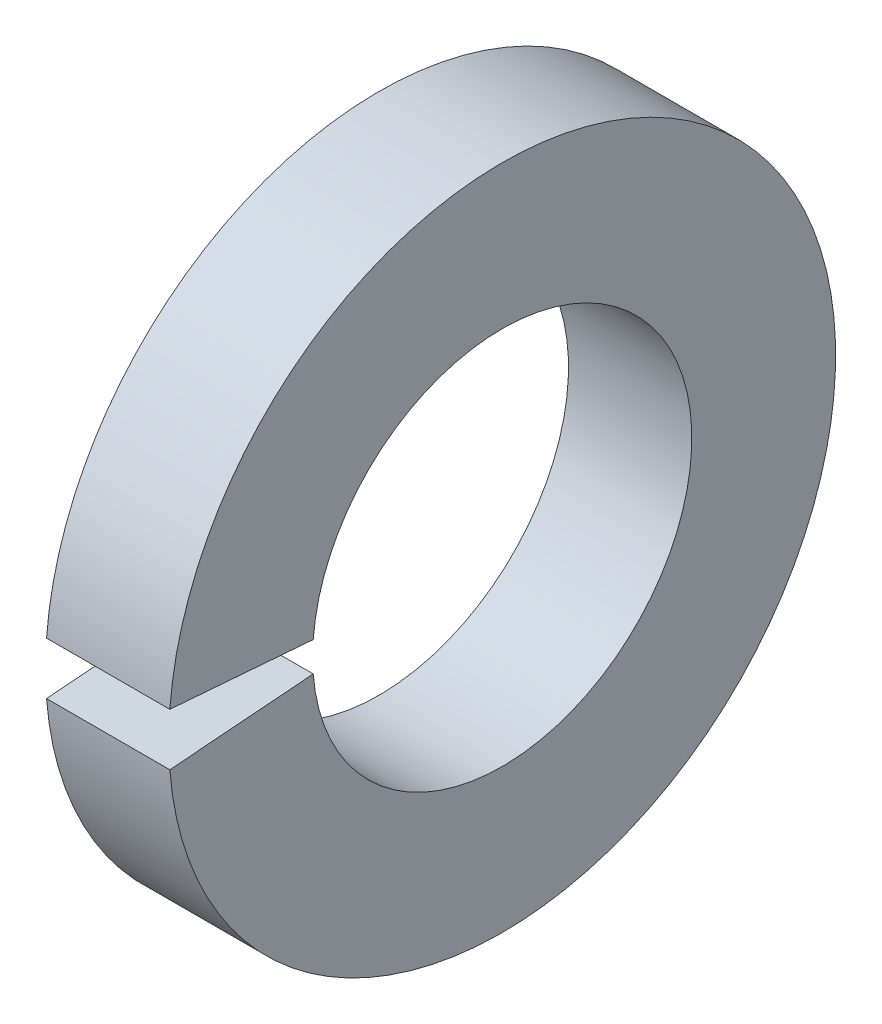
from build123d import *

# Parameters (mm, degrees)
SKETCH1_W = 8.382
SKETCH1_H = 9.779
GAP_DEPTH = 34.137145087


with BuildPart() as part:
    # Sketch1 → Base-Revolve (revolve)
    with BuildSketch(Plane.XY, mode=Mode.PRIVATE) as base_revolve_sk:
        with Locations((-4.191, 17.78)):
            Rectangle(SKETCH1_W, SKETCH1_H)
    revolve(base_revolve_sk.sketch.rotate(Axis((-34.925, 0, 0), (1, 0, 0)), 90), axis=Axis((-34.925, 0, 0), (1, 0, 0)))

    # Sketch2 → Gap (cut, through all)
    with BuildSketch(Plane(origin=(0, 0, 0), x_dir=(0, -1, 0), z_dir=(-1, 0, 0))):
        with BuildLine():
            Line((0, 0), (1.81420104, 23.051609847))
            ThreePointArc((1.81420104, 23.051609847), (0, 23.12289), (-1.81420104, 23.051609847))
            Line((-1.81420104, 23.051609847), (0, 0))
        make_face()
    extrude(amount=GAP_DEPTH, mode=Mode.SUBTRACT)


solid = part.part
